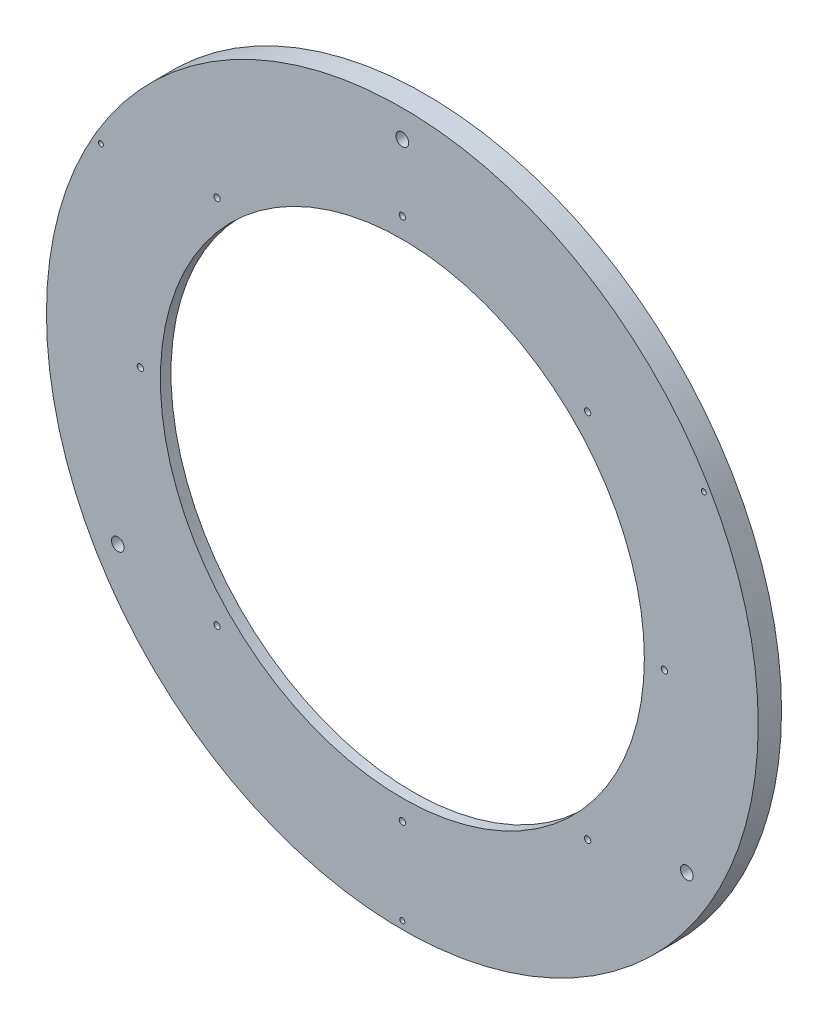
from build123d import *

# Parameters (mm, degrees)
F_1_4_20_TAPPED_HOLE1_D = 5.1054
CIRPATTERN1_COUNT       = 8
F_3_8_CLEARANCE_HOLE1_D = 10.31748
F_10_32_TAPPED_HOLE1_D  = 4.0386


with BuildPart() as part:
    # Sketch1 → Revolve1 (revolve)
    with BuildSketch(Plane(origin=(0, 0, 0), x_dir=(1, 0, 0), z_dir=(0, 1, 0))):
        Polygon((196.453125, 0), (288.925, 0), (288.925, 18.923), (276.225, 18.923), (276.225, 25.146), (222.25, 25.146), (222.25, 8.636), (196.453125, 8.636), align=None)
    revolve(axis=Axis((0, 0, 0), (0, 0, -1)))

    # 1_4-20 Tapped Hole1 (through all)
    with Locations(Plane(origin=(0, 0, -8.636), x_dir=(-1, 0, 0), z_dir=(0, 0, -1))):
        with Locations((0, 212.725)):
            f_1_4_20_tapped_hole1 = Hole(F_1_4_20_TAPPED_HOLE1_D / 2)

    # CirPattern1: 1_4-20 Tapped Hole1 ×8 about axis
    cirpattern1_axis = Axis((0, 0, 0), (0, 0, 1))
    for i in range(1, CIRPATTERN1_COUNT):
        add(f_1_4_20_tapped_hole1.rotate(cirpattern1_axis, i * 360 / CIRPATTERN1_COUNT), mode=Mode.SUBTRACT)

    # 3_8 Clearance Hole1 (through all)
    with Locations(Plane(origin=(0, 0, -25.146), x_dir=(-1, 0, 0), z_dir=(0, 0, -1))):
        with Locations((0, 266.7), (230.968975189, -133.35), (-230.968975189, -133.35)):
            Hole(F_3_8_CLEARANCE_HOLE1_D / 2)

    # 10-32 Tapped Hole1 (through all)
    with Locations(Plane(origin=(0, 0, -18.923), x_dir=(-1, 0, 0), z_dir=(0, 0, -1))):
        with Locations((0, -282.575), (244.717128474, 141.2875), (-244.717128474, 141.2875)):
            Hole(F_10_32_TAPPED_HOLE1_D / 2)


solid = part.part
